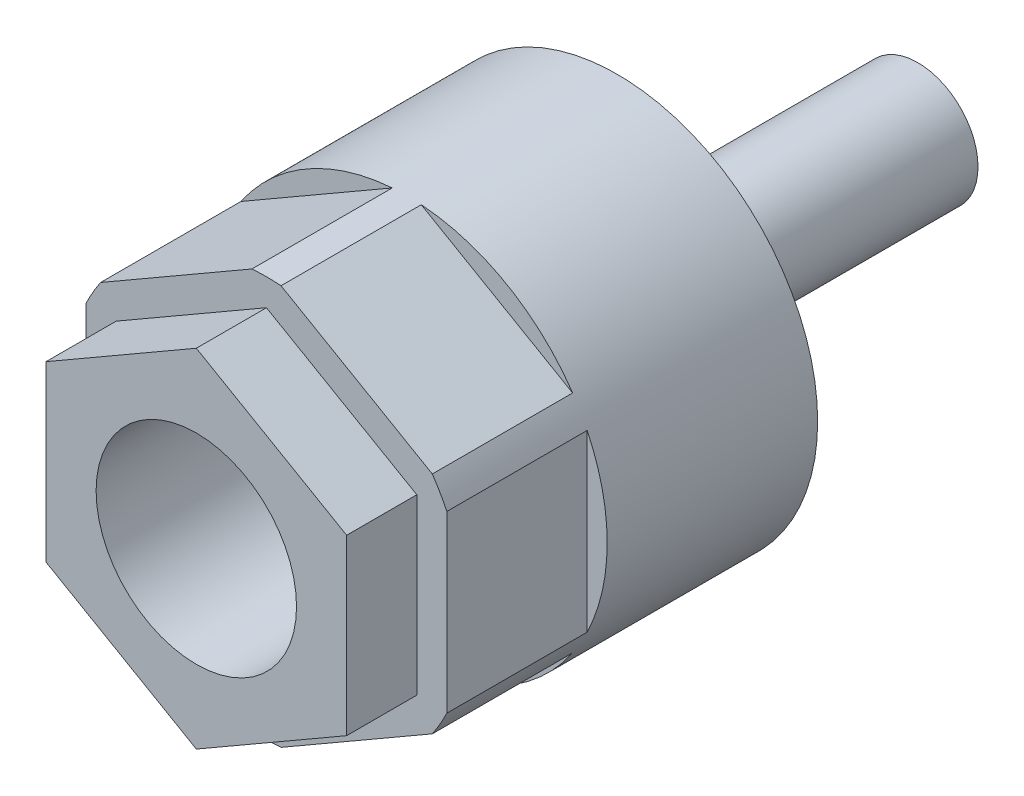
ISO-10303-21;
HEADER;
FILE_DESCRIPTION(('STEP AP214'),'2;1');
FILE_NAME('part.step','',(''),(''),'','','');
FILE_SCHEMA(('AUTOMOTIVE_DESIGN { 1 0 10303 214 1 1 1 1 }'));
ENDSEC;
DATA;
#1=APPLICATION_CONTEXT('core data for automotive mechanical design processes');
#2=APPLICATION_PROTOCOL_DEFINITION('international standard','automotive_design',2000,#1);
#3=PRODUCT_CONTEXT('',#1,'mechanical');
#4=PRODUCT('Part','Part','',(#3));
#5=PRODUCT_RELATED_PRODUCT_CATEGORY('part','',(#4));
#6=PRODUCT_DEFINITION_FORMATION('','',#4);
#7=PRODUCT_DEFINITION_CONTEXT('part definition',#1,'design');
#8=PRODUCT_DEFINITION('design','',#6,#7);
#9=PRODUCT_DEFINITION_SHAPE('','',#8);
#10=(LENGTH_UNIT() NAMED_UNIT(*) SI_UNIT(.MILLI.,.METRE.));
#11=(NAMED_UNIT(*) PLANE_ANGLE_UNIT() SI_UNIT($,.RADIAN.));
#12=(NAMED_UNIT(*) SI_UNIT($,.STERADIAN.) SOLID_ANGLE_UNIT());
#13=UNCERTAINTY_MEASURE_WITH_UNIT(LENGTH_MEASURE(1.E-05),#10,'distance_accuracy_value','');
#14=(GEOMETRIC_REPRESENTATION_CONTEXT(3) GLOBAL_UNCERTAINTY_ASSIGNED_CONTEXT((#13)) GLOBAL_UNIT_ASSIGNED_CONTEXT((#10,
#11,#12)) REPRESENTATION_CONTEXT('',''));
#15=CARTESIAN_POINT('',(0.,0.,0.));
#16=DIRECTION('',(0.,0.,1.));
#17=DIRECTION('',(1.,0.,0.));
#18=AXIS2_PLACEMENT_3D('',#15,#16,#17);
#19=CARTESIAN_POINT('',(0.,0.,80.));
#20=DIRECTION('',(0.,0.,1.));
#21=DIRECTION('',(1.,0.,0.));
#22=AXIS2_PLACEMENT_3D('',#19,#20,#21);
#23=CYLINDRICAL_SURFACE('',#22,20.);
#24=CARTESIAN_POINT('',(0.,0.,0.));
#25=DIRECTION('',(0.,0.,1.));
#26=DIRECTION('',(1.,0.,0.));
#27=AXIS2_PLACEMENT_3D('',#24,#25,#26);
#28=CIRCLE('',#27,20.);
#29=CARTESIAN_POINT('',(20.,0.,0.));
#30=VERTEX_POINT('',#29);
#31=EDGE_CURVE('E241',#30,#30,#28,.T.);
#32=ORIENTED_EDGE('',*,*,#31,.T.);
#33=EDGE_LOOP('',(#32));
#34=FACE_BOUND('',#33,.T.);
#35=DIRECTION('',(0.,0.,1.));
#36=VECTOR('',#35,1.);
#37=CARTESIAN_POINT('',(18.,-8.71779788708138,80.));
#38=LINE('',#37,#36);
#39=CARTESIAN_POINT('',(18.,-8.71779788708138,21.));
#40=VERTEX_POINT('',#39);
#41=CARTESIAN_POINT('',(18.,-8.71779788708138,35.));
#42=VERTEX_POINT('',#41);
#43=EDGE_CURVE('E271',#40,#42,#38,.T.);
#44=ORIENTED_EDGE('',*,*,#43,.T.);
#45=CARTESIAN_POINT('',(0.,0.,35.));
#46=DIRECTION('',(0.,0.,1.));
#47=DIRECTION('',(1.,0.,0.));
#48=AXIS2_PLACEMENT_3D('',#45,#46,#47);
#49=CIRCLE('',#48,20.);
#50=CARTESIAN_POINT('',(16.5498344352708,-11.2295583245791,35.));
#51=VERTEX_POINT('',#50);
#52=EDGE_CURVE('E205',#42,#51,#49,.F.);
#53=ORIENTED_EDGE('',*,*,#52,.T.);
#54=DIRECTION('',(0.,0.,1.));
#55=VECTOR('',#54,1.);
#56=CARTESIAN_POINT('',(16.5498344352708,-11.2295583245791,80.));
#57=LINE('',#56,#55);
#58=CARTESIAN_POINT('',(16.5498344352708,-11.2295583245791,21.));
#59=VERTEX_POINT('',#58);
#60=EDGE_CURVE('E265',#59,#51,#57,.T.);
#61=ORIENTED_EDGE('',*,*,#60,.F.);
#62=CARTESIAN_POINT('',(0.,0.,21.));
#63=DIRECTION('',(0.,0.,1.));
#64=DIRECTION('',(1.,0.,0.));
#65=AXIS2_PLACEMENT_3D('',#62,#63,#64);
#66=CIRCLE('',#65,20.);
#67=CARTESIAN_POINT('',(1.45016556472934,-19.9473562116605,21.));
#68=VERTEX_POINT('',#67);
#69=EDGE_CURVE('E268',#59,#68,#66,.F.);
#70=ORIENTED_EDGE('',*,*,#69,.T.);
#71=DIRECTION('',(0.,0.,1.));
#72=VECTOR('',#71,1.);
#73=CARTESIAN_POINT('',(1.45016556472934,-19.9473562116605,80.));
#74=LINE('',#73,#72);
#75=CARTESIAN_POINT('',(1.45016556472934,-19.9473562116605,35.));
#76=VERTEX_POINT('',#75);
#77=EDGE_CURVE('E269',#76,#68,#74,.F.);
#78=ORIENTED_EDGE('',*,*,#77,.F.);
#79=CARTESIAN_POINT('',(-1.45016556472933,-19.9473562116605,35.));
#80=VERTEX_POINT('',#79);
#81=EDGE_CURVE('E195',#76,#80,#49,.F.);
#82=ORIENTED_EDGE('',*,*,#81,.T.);
#83=DIRECTION('',(0.,0.,1.));
#84=VECTOR('',#83,1.);
#85=CARTESIAN_POINT('',(-1.45016556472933,-19.9473562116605,80.));
#86=LINE('',#85,#84);
#87=CARTESIAN_POINT('',(-1.45016556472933,-19.9473562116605,21.));
#88=VERTEX_POINT('',#87);
#89=EDGE_CURVE('E263',#80,#88,#86,.F.);
#90=ORIENTED_EDGE('',*,*,#89,.T.);
#91=CARTESIAN_POINT('',(-16.5498344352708,-11.2295583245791,21.));
#92=VERTEX_POINT('',#91);
#93=EDGE_CURVE('E262',#88,#92,#66,.F.);
#94=ORIENTED_EDGE('',*,*,#93,.T.);
#95=DIRECTION('',(0.,0.,1.));
#96=VECTOR('',#95,1.);
#97=CARTESIAN_POINT('',(-16.5498344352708,-11.2295583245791,80.));
#98=LINE('',#97,#96);
#99=CARTESIAN_POINT('',(-16.5498344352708,-11.2295583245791,35.));
#100=VERTEX_POINT('',#99);
#101=EDGE_CURVE('E259',#92,#100,#98,.T.);
#102=ORIENTED_EDGE('',*,*,#101,.T.);
#103=CARTESIAN_POINT('',(-18.,-8.71779788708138,35.));
#104=VERTEX_POINT('',#103);
#105=EDGE_CURVE('E207',#100,#104,#49,.F.);
#106=ORIENTED_EDGE('',*,*,#105,.T.);
#107=DIRECTION('',(0.,0.,1.));
#108=VECTOR('',#107,1.);
#109=CARTESIAN_POINT('',(-18.,-8.71779788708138,80.));
#110=LINE('',#109,#108);
#111=CARTESIAN_POINT('',(-18.,-8.71779788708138,21.));
#112=VERTEX_POINT('',#111);
#113=EDGE_CURVE('E254',#112,#104,#110,.T.);
#114=ORIENTED_EDGE('',*,*,#113,.F.);
#115=CARTESIAN_POINT('',(-18.,8.71779788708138,21.));
#116=VERTEX_POINT('',#115);
#117=EDGE_CURVE('E252',#112,#116,#66,.F.);
#118=ORIENTED_EDGE('',*,*,#117,.T.);
#119=DIRECTION('',(0.,0.,1.));
#120=VECTOR('',#119,1.);
#121=CARTESIAN_POINT('',(-18.,8.71779788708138,80.));
#122=LINE('',#121,#120);
#123=CARTESIAN_POINT('',(-18.,8.71779788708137,35.));
#124=VERTEX_POINT('',#123);
#125=EDGE_CURVE('E257',#124,#116,#122,.F.);
#126=ORIENTED_EDGE('',*,*,#125,.F.);
#127=CARTESIAN_POINT('',(-16.5498344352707,11.2295583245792,35.));
#128=VERTEX_POINT('',#127);
#129=EDGE_CURVE('E201',#124,#128,#49,.F.);
#130=ORIENTED_EDGE('',*,*,#129,.T.);
#131=DIRECTION('',(0.,0.,1.));
#132=VECTOR('',#131,1.);
#133=CARTESIAN_POINT('',(-16.5498344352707,11.2295583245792,80.));
#134=LINE('',#133,#132);
#135=CARTESIAN_POINT('',(-16.5498344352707,11.2295583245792,21.));
#136=VERTEX_POINT('',#135);
#137=EDGE_CURVE('E244',#136,#128,#134,.T.);
#138=ORIENTED_EDGE('',*,*,#137,.F.);
#139=CARTESIAN_POINT('',(-1.45016556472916,19.9473562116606,21.));
#140=VERTEX_POINT('',#139);
#141=EDGE_CURVE('E247',#136,#140,#66,.F.);
#142=ORIENTED_EDGE('',*,*,#141,.T.);
#143=DIRECTION('',(0.,0.,1.));
#144=VECTOR('',#143,1.);
#145=CARTESIAN_POINT('',(-1.45016556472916,19.9473562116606,80.));
#146=LINE('',#145,#144);
#147=CARTESIAN_POINT('',(-1.45016556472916,19.9473562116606,35.));
#148=VERTEX_POINT('',#147);
#149=EDGE_CURVE('E250',#148,#140,#146,.F.);
#150=ORIENTED_EDGE('',*,*,#149,.F.);
#151=CARTESIAN_POINT('',(1.45016556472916,19.9473562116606,35.));
#152=VERTEX_POINT('',#151);
#153=EDGE_CURVE('E194',#148,#152,#49,.F.);
#154=ORIENTED_EDGE('',*,*,#153,.T.);
#155=DIRECTION('',(0.,0.,1.));
#156=VECTOR('',#155,1.);
#157=CARTESIAN_POINT('',(1.45016556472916,19.9473562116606,80.));
#158=LINE('',#157,#156);
#159=CARTESIAN_POINT('',(1.45016556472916,19.9473562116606,21.));
#160=VERTEX_POINT('',#159);
#161=EDGE_CURVE('E22',#152,#160,#158,.F.);
#162=ORIENTED_EDGE('',*,*,#161,.T.);
#163=CARTESIAN_POINT('',(16.5498344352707,11.2295583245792,21.));
#164=VERTEX_POINT('',#163);
#165=EDGE_CURVE('E251',#160,#164,#66,.F.);
#166=ORIENTED_EDGE('',*,*,#165,.T.);
#167=DIRECTION('',(0.,0.,1.));
#168=VECTOR('',#167,1.);
#169=CARTESIAN_POINT('',(16.5498344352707,11.2295583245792,80.));
#170=LINE('',#169,#168);
#171=CARTESIAN_POINT('',(16.5498344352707,11.2295583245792,35.));
#172=VERTEX_POINT('',#171);
#173=EDGE_CURVE('E277',#164,#172,#170,.T.);
#174=ORIENTED_EDGE('',*,*,#173,.T.);
#175=CARTESIAN_POINT('',(18.,8.71779788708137,35.));
#176=VERTEX_POINT('',#175);
#177=EDGE_CURVE('E37',#172,#176,#49,.F.);
#178=ORIENTED_EDGE('',*,*,#177,.T.);
#179=DIRECTION('',(0.,0.,1.));
#180=VECTOR('',#179,1.);
#181=CARTESIAN_POINT('',(18.,8.71779788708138,80.));
#182=LINE('',#181,#180);
#183=CARTESIAN_POINT('',(18.,8.71779788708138,21.));
#184=VERTEX_POINT('',#183);
#185=EDGE_CURVE('E275',#176,#184,#182,.F.);
#186=ORIENTED_EDGE('',*,*,#185,.T.);
#187=EDGE_CURVE('E274',#184,#40,#66,.F.);
#188=ORIENTED_EDGE('',*,*,#187,.T.);
#189=EDGE_LOOP('',(#44,#53,#61,#70,#78,#82,#90,#94,#102,#106,#114,#118,#126,#130,#138,#142,#150,
#154,#162,#166,#174,#178,#186,#188));
#190=FACE_BOUND('',#189,.T.);
#191=ADVANCED_FACE('F14',(#34,#190),#23,.T.);
#192=CARTESIAN_POINT('',(-18.,10.3923048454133,21.));
#193=DIRECTION('',(0.5,-0.86602540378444,0.));
#194=DIRECTION('',(0.86602540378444,0.5,0.));
#195=AXIS2_PLACEMENT_3D('',#192,#193,#194);
#196=PLANE('',#195);
#197=DIRECTION('',(-0.86602540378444,-0.5,0.));
#198=VECTOR('',#197,1.);
#199=CARTESIAN_POINT('',(-18.,10.3923048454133,35.));
#200=LINE('',#199,#198);
#201=EDGE_CURVE('E199',#148,#128,#200,.T.);
#202=ORIENTED_EDGE('',*,*,#201,.F.);
#203=ORIENTED_EDGE('',*,*,#149,.T.);
#204=DIRECTION('',(0.86602540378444,0.5,0.));
#205=VECTOR('',#204,1.);
#206=CARTESIAN_POINT('',(-18.,10.3923048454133,21.));
#207=LINE('',#206,#205);
#208=EDGE_CURVE('E225',#136,#140,#207,.T.);
#209=ORIENTED_EDGE('',*,*,#208,.F.);
#210=ORIENTED_EDGE('',*,*,#137,.T.);
#211=EDGE_LOOP('',(#202,#203,#209,#210));
#212=FACE_BOUND('',#211,.T.);
#213=ADVANCED_FACE('F334',(#212),#196,.F.);
#214=CARTESIAN_POINT('',(-18.,-10.3923048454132,21.));
#215=DIRECTION('',(1.,0.,0.));
#216=DIRECTION('',(0.,0.,-1.));
#217=AXIS2_PLACEMENT_3D('',#214,#215,#216);
#218=PLANE('',#217);
#219=DIRECTION('',(0.,-1.,0.));
#220=VECTOR('',#219,1.);
#221=CARTESIAN_POINT('',(-18.,-10.3923048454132,35.));
#222=LINE('',#221,#220);
#223=EDGE_CURVE('E204',#124,#104,#222,.T.);
#224=ORIENTED_EDGE('',*,*,#223,.F.);
#225=ORIENTED_EDGE('',*,*,#125,.T.);
#226=DIRECTION('',(0.,1.,0.));
#227=VECTOR('',#226,1.);
#228=CARTESIAN_POINT('',(-18.,-10.3923048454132,21.));
#229=LINE('',#228,#227);
#230=EDGE_CURVE('E222',#112,#116,#229,.T.);
#231=ORIENTED_EDGE('',*,*,#230,.F.);
#232=ORIENTED_EDGE('',*,*,#113,.T.);
#233=EDGE_LOOP('',(#224,#225,#231,#232));
#234=FACE_BOUND('',#233,.T.);
#235=ADVANCED_FACE('F302',(#234),#218,.F.);
#236=CARTESIAN_POINT('',(-18.,-10.3923048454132,21.));
#237=DIRECTION('',(-0.5,-0.866025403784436,0.));
#238=DIRECTION('',(0.866025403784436,-0.5,0.));
#239=AXIS2_PLACEMENT_3D('',#236,#237,#238);
#240=PLANE('',#239);
#241=ORIENTED_EDGE('',*,*,#89,.F.);
#242=DIRECTION('',(-0.866025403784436,0.5,0.));
#243=VECTOR('',#242,1.);
#244=CARTESIAN_POINT('',(-18.,-10.3923048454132,35.));
#245=LINE('',#244,#243);
#246=EDGE_CURVE('E208',#80,#100,#245,.T.);
#247=ORIENTED_EDGE('',*,*,#246,.T.);
#248=ORIENTED_EDGE('',*,*,#101,.F.);
#249=DIRECTION('',(0.866025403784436,-0.5,0.));
#250=VECTOR('',#249,1.);
#251=CARTESIAN_POINT('',(-18.,-10.3923048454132,21.));
#252=LINE('',#251,#250);
#253=EDGE_CURVE('E219',#92,#88,#252,.T.);
#254=ORIENTED_EDGE('',*,*,#253,.T.);
#255=EDGE_LOOP('',(#241,#247,#248,#254));
#256=FACE_BOUND('',#255,.T.);
#257=ADVANCED_FACE('F489',(#256),#240,.T.);
#258=CARTESIAN_POINT('',(18.,-10.3923048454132,21.));
#259=DIRECTION('',(-0.5,0.866025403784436,0.));
#260=DIRECTION('',(-0.866025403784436,-0.5,0.));
#261=AXIS2_PLACEMENT_3D('',#258,#259,#260);
#262=PLANE('',#261);
#263=DIRECTION('',(0.866025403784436,0.5,0.));
#264=VECTOR('',#263,1.);
#265=CARTESIAN_POINT('',(18.,-10.3923048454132,35.));
#266=LINE('',#265,#264);
#267=EDGE_CURVE('E202',#76,#51,#266,.T.);
#268=ORIENTED_EDGE('',*,*,#267,.F.);
#269=ORIENTED_EDGE('',*,*,#77,.T.);
#270=DIRECTION('',(-0.866025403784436,-0.5,0.));
#271=VECTOR('',#270,1.);
#272=CARTESIAN_POINT('',(18.,-10.3923048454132,21.));
#273=LINE('',#272,#271);
#274=EDGE_CURVE('E216',#59,#68,#273,.T.);
#275=ORIENTED_EDGE('',*,*,#274,.F.);
#276=ORIENTED_EDGE('',*,*,#60,.T.);
#277=EDGE_LOOP('',(#268,#269,#275,#276));
#278=FACE_BOUND('',#277,.T.);
#279=ADVANCED_FACE('F480',(#278),#262,.F.);
#280=CARTESIAN_POINT('',(18.,-10.3923048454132,21.));
#281=DIRECTION('',(1.,0.,0.));
#282=DIRECTION('',(0.,0.,-1.));
#283=AXIS2_PLACEMENT_3D('',#280,#281,#282);
#284=PLANE('',#283);
#285=ORIENTED_EDGE('',*,*,#185,.F.);
#286=DIRECTION('',(0.,-1.,0.));
#287=VECTOR('',#286,1.);
#288=CARTESIAN_POINT('',(18.,-10.3923048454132,35.));
#289=LINE('',#288,#287);
#290=EDGE_CURVE('E196',#176,#42,#289,.T.);
#291=ORIENTED_EDGE('',*,*,#290,.T.);
#292=ORIENTED_EDGE('',*,*,#43,.F.);
#293=DIRECTION('',(0.,1.,0.));
#294=VECTOR('',#293,1.);
#295=CARTESIAN_POINT('',(18.,-10.3923048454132,21.));
#296=LINE('',#295,#294);
#297=EDGE_CURVE('E212',#40,#184,#296,.T.);
#298=ORIENTED_EDGE('',*,*,#297,.T.);
#299=EDGE_LOOP('',(#285,#291,#292,#298));
#300=FACE_BOUND('',#299,.T.);
#301=ADVANCED_FACE('F470',(#300),#284,.T.);
#302=CARTESIAN_POINT('',(18.,10.3923048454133,21.));
#303=DIRECTION('',(0.5,0.86602540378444,0.));
#304=DIRECTION('',(-0.86602540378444,0.5,0.));
#305=AXIS2_PLACEMENT_3D('',#302,#303,#304);
#306=PLANE('',#305);
#307=ORIENTED_EDGE('',*,*,#161,.F.);
#308=DIRECTION('',(0.86602540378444,-0.5,0.));
#309=VECTOR('',#308,1.);
#310=CARTESIAN_POINT('',(18.,10.3923048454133,35.));
#311=LINE('',#310,#309);
#312=EDGE_CURVE('E9',#152,#172,#311,.T.);
#313=ORIENTED_EDGE('',*,*,#312,.T.);
#314=ORIENTED_EDGE('',*,*,#173,.F.);
#315=DIRECTION('',(-0.86602540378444,0.5,0.));
#316=VECTOR('',#315,1.);
#317=CARTESIAN_POINT('',(18.,10.3923048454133,21.));
#318=LINE('',#317,#316);
#319=EDGE_CURVE('E211',#164,#160,#318,.T.);
#320=ORIENTED_EDGE('',*,*,#319,.T.);
#321=EDGE_LOOP('',(#307,#313,#314,#320));
#322=FACE_BOUND('',#321,.T.);
#323=ADVANCED_FACE('F311',(#322),#306,.T.);
#324=CARTESIAN_POINT('',(20.,0.,0.));
#325=DIRECTION('',(0.,0.,-1.));
#326=DIRECTION('',(-1.,0.,0.));
#327=AXIS2_PLACEMENT_3D('',#324,#325,#326);
#328=PLANE('',#327);
#329=CARTESIAN_POINT('',(0.,0.,0.));
#330=DIRECTION('',(0.,0.,1.));
#331=DIRECTION('',(1.,0.,0.));
#332=AXIS2_PLACEMENT_3D('',#329,#330,#331);
#333=CIRCLE('',#332,6.);
#334=CARTESIAN_POINT('',(6.,0.,0.));
#335=VERTEX_POINT('',#334);
#336=EDGE_CURVE('E238',#335,#335,#333,.T.);
#337=ORIENTED_EDGE('',*,*,#336,.T.);
#338=EDGE_LOOP('',(#337));
#339=FACE_BOUND('',#338,.T.);
#340=ORIENTED_EDGE('',*,*,#31,.F.);
#341=EDGE_LOOP('',(#340));
#342=FACE_BOUND('',#341,.T.);
#343=ADVANCED_FACE('F343',(#339,#342),#328,.T.);
#344=CARTESIAN_POINT('',(0.,0.,80.));
#345=DIRECTION('',(0.,0.,1.));
#346=DIRECTION('',(1.,0.,0.));
#347=AXIS2_PLACEMENT_3D('',#344,#345,#346);
#348=CYLINDRICAL_SURFACE('',#347,6.);
#349=CARTESIAN_POINT('',(0.,0.,-30.));
#350=DIRECTION('',(0.,0.,1.));
#351=DIRECTION('',(1.,0.,0.));
#352=AXIS2_PLACEMENT_3D('',#349,#350,#351);
#353=CIRCLE('',#352,6.);
#354=CARTESIAN_POINT('',(6.,0.,-30.));
#355=VERTEX_POINT('',#354);
#356=EDGE_CURVE('E235',#355,#355,#353,.T.);
#357=ORIENTED_EDGE('',*,*,#356,.T.);
#358=EDGE_LOOP('',(#357));
#359=FACE_BOUND('',#358,.T.);
#360=ORIENTED_EDGE('',*,*,#336,.F.);
#361=EDGE_LOOP('',(#360));
#362=FACE_BOUND('',#361,.T.);
#363=ADVANCED_FACE('F346',(#359,#362),#348,.T.);
#364=CARTESIAN_POINT('',(6.,0.,-30.));
#365=DIRECTION('',(0.,0.,-1.));
#366=DIRECTION('',(-1.,0.,0.));
#367=AXIS2_PLACEMENT_3D('',#364,#365,#366);
#368=PLANE('',#367);
#369=ORIENTED_EDGE('',*,*,#356,.F.);
#370=EDGE_LOOP('',(#369));
#371=FACE_BOUND('',#370,.T.);
#372=ADVANCED_FACE('F331',(#371),#368,.T.);
#373=CARTESIAN_POINT('',(0.,0.,21.));
#374=DIRECTION('',(0.,0.,1.));
#375=DIRECTION('',(1.,0.,0.));
#376=AXIS2_PLACEMENT_3D('',#373,#374,#375);
#377=PLANE('',#376);
#378=ORIENTED_EDGE('',*,*,#208,.T.);
#379=ORIENTED_EDGE('',*,*,#141,.F.);
#380=EDGE_LOOP('',(#378,#379));
#381=FACE_BOUND('',#380,.T.);
#382=ADVANCED_FACE('F318',(#381),#377,.T.);
#383=ORIENTED_EDGE('',*,*,#230,.T.);
#384=ORIENTED_EDGE('',*,*,#117,.F.);
#385=EDGE_LOOP('',(#383,#384));
#386=FACE_BOUND('',#385,.T.);
#387=ADVANCED_FACE('F299',(#386),#377,.T.);
#388=ORIENTED_EDGE('',*,*,#253,.F.);
#389=ORIENTED_EDGE('',*,*,#93,.F.);
#390=EDGE_LOOP('',(#388,#389));
#391=FACE_BOUND('',#390,.T.);
#392=ADVANCED_FACE('F444',(#391),#377,.T.);
#393=ORIENTED_EDGE('',*,*,#274,.T.);
#394=ORIENTED_EDGE('',*,*,#69,.F.);
#395=EDGE_LOOP('',(#393,#394));
#396=FACE_BOUND('',#395,.T.);
#397=ADVANCED_FACE('F326',(#396),#377,.T.);
#398=ORIENTED_EDGE('',*,*,#297,.F.);
#399=ORIENTED_EDGE('',*,*,#187,.F.);
#400=EDGE_LOOP('',(#398,#399));
#401=FACE_BOUND('',#400,.T.);
#402=ADVANCED_FACE('F316',(#401),#377,.T.);
#403=ORIENTED_EDGE('',*,*,#319,.F.);
#404=ORIENTED_EDGE('',*,*,#165,.F.);
#405=EDGE_LOOP('',(#403,#404));
#406=FACE_BOUND('',#405,.T.);
#407=ADVANCED_FACE('F314',(#406),#377,.T.);
#408=CARTESIAN_POINT('',(0.,0.,35.));
#409=DIRECTION('',(0.,0.,1.));
#410=DIRECTION('',(1.,0.,0.));
#411=AXIS2_PLACEMENT_3D('',#408,#409,#410);
#412=PLANE('',#411);
#413=ORIENTED_EDGE('',*,*,#81,.F.);
#414=ORIENTED_EDGE('',*,*,#267,.T.);
#415=ORIENTED_EDGE('',*,*,#52,.F.);
#416=ORIENTED_EDGE('',*,*,#290,.F.);
#417=ORIENTED_EDGE('',*,*,#177,.F.);
#418=ORIENTED_EDGE('',*,*,#312,.F.);
#419=ORIENTED_EDGE('',*,*,#153,.F.);
#420=ORIENTED_EDGE('',*,*,#201,.T.);
#421=ORIENTED_EDGE('',*,*,#129,.F.);
#422=ORIENTED_EDGE('',*,*,#223,.T.);
#423=ORIENTED_EDGE('',*,*,#105,.F.);
#424=ORIENTED_EDGE('',*,*,#246,.F.);
#425=EDGE_LOOP('',(#413,#414,#415,#416,#417,#418,#419,#420,#421,#422,#423,#424));
#426=FACE_BOUND('',#425,.T.);
#427=DIRECTION('',(-0.866025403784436,-0.5,0.));
#428=VECTOR('',#427,1.);
#429=CARTESIAN_POINT('',(15.,-8.66025403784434,35.));
#430=LINE('',#429,#428);
#431=CARTESIAN_POINT('',(15.,-8.66025403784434,35.));
#432=VERTEX_POINT('',#431);
#433=CARTESIAN_POINT('',(0.,-17.3205080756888,35.));
#434=VERTEX_POINT('',#433);
#435=EDGE_CURVE('E182',#432,#434,#430,.T.);
#436=ORIENTED_EDGE('',*,*,#435,.T.);
#437=DIRECTION('',(0.866025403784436,-0.5,0.));
#438=VECTOR('',#437,1.);
#439=CARTESIAN_POINT('',(-15.,-8.66025403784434,35.));
#440=LINE('',#439,#438);
#441=CARTESIAN_POINT('',(-15.,-8.66025403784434,35.));
#442=VERTEX_POINT('',#441);
#443=EDGE_CURVE('E146',#442,#434,#440,.T.);
#444=ORIENTED_EDGE('',*,*,#443,.F.);
#445=DIRECTION('',(0.,1.,0.));
#446=VECTOR('',#445,1.);
#447=CARTESIAN_POINT('',(-15.,-8.66025403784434,35.));
#448=LINE('',#447,#446);
#449=CARTESIAN_POINT('',(-15.,8.66025403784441,35.));
#450=VERTEX_POINT('',#449);
#451=EDGE_CURVE('E178',#442,#450,#448,.T.);
#452=ORIENTED_EDGE('',*,*,#451,.T.);
#453=DIRECTION('',(0.866025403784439,0.5,0.));
#454=VECTOR('',#453,1.);
#455=CARTESIAN_POINT('',(-15.,8.66025403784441,35.));
#456=LINE('',#455,#454);
#457=CARTESIAN_POINT('',(0.,17.3205080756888,35.));
#458=VERTEX_POINT('',#457);
#459=EDGE_CURVE('E175',#450,#458,#456,.T.);
#460=ORIENTED_EDGE('',*,*,#459,.T.);
#461=DIRECTION('',(-0.866025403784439,0.5,0.));
#462=VECTOR('',#461,1.);
#463=CARTESIAN_POINT('',(15.,8.66025403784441,35.));
#464=LINE('',#463,#462);
#465=CARTESIAN_POINT('',(15.,8.66025403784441,35.));
#466=VERTEX_POINT('',#465);
#467=EDGE_CURVE('E172',#466,#458,#464,.T.);
#468=ORIENTED_EDGE('',*,*,#467,.F.);
#469=DIRECTION('',(0.,1.,0.));
#470=VECTOR('',#469,1.);
#471=CARTESIAN_POINT('',(15.,-8.66025403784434,35.));
#472=LINE('',#471,#470);
#473=EDGE_CURVE('E169',#432,#466,#472,.T.);
#474=ORIENTED_EDGE('',*,*,#473,.F.);
#475=EDGE_LOOP('',(#436,#444,#452,#460,#468,#474));
#476=FACE_BOUND('',#475,.T.);
#477=ADVANCED_FACE('F303',(#426,#476),#412,.T.);
#478=CARTESIAN_POINT('',(15.,-8.66025403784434,35.));
#479=DIRECTION('',(-0.5,0.866025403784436,0.));
#480=DIRECTION('',(-0.866025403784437,-0.5,0.));
#481=AXIS2_PLACEMENT_3D('',#478,#479,#480);
#482=PLANE('',#481);
#483=DIRECTION('',(0.,0.,1.));
#484=VECTOR('',#483,1.);
#485=CARTESIAN_POINT('',(0.,-17.3205080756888,35.));
#486=LINE('',#485,#484);
#487=CARTESIAN_POINT('',(0.,-17.3205080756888,42.));
#488=VERTEX_POINT('',#487);
#489=EDGE_CURVE('E139',#434,#488,#486,.T.);
#490=ORIENTED_EDGE('',*,*,#489,.F.);
#491=ORIENTED_EDGE('',*,*,#435,.F.);
#492=DIRECTION('',(0.,0.,1.));
#493=VECTOR('',#492,1.);
#494=CARTESIAN_POINT('',(15.,-8.66025403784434,35.));
#495=LINE('',#494,#493);
#496=CARTESIAN_POINT('',(15.,-8.66025403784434,42.));
#497=VERTEX_POINT('',#496);
#498=EDGE_CURVE('E155',#432,#497,#495,.T.);
#499=ORIENTED_EDGE('',*,*,#498,.T.);
#500=DIRECTION('',(-0.866025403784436,-0.5,0.));
#501=VECTOR('',#500,1.);
#502=CARTESIAN_POINT('',(15.,-8.66025403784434,42.));
#503=LINE('',#502,#501);
#504=EDGE_CURVE('E153',#497,#488,#503,.T.);
#505=ORIENTED_EDGE('',*,*,#504,.T.);
#506=EDGE_LOOP('',(#490,#491,#499,#505));
#507=FACE_BOUND('',#506,.T.);
#508=ADVANCED_FACE('F154',(#507),#482,.F.);
#509=CARTESIAN_POINT('',(-15.,-8.66025403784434,35.));
#510=DIRECTION('',(-0.5,-0.866025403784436,0.));
#511=DIRECTION('',(0.866025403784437,-0.5,0.));
#512=AXIS2_PLACEMENT_3D('',#509,#510,#511);
#513=PLANE('',#512);
#514=DIRECTION('',(0.,0.,1.));
#515=VECTOR('',#514,1.);
#516=CARTESIAN_POINT('',(-15.,-8.66025403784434,35.));
#517=LINE('',#516,#515);
#518=CARTESIAN_POINT('',(-15.,-8.66025403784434,42.));
#519=VERTEX_POINT('',#518);
#520=EDGE_CURVE('E150',#442,#519,#517,.T.);
#521=ORIENTED_EDGE('',*,*,#520,.F.);
#522=ORIENTED_EDGE('',*,*,#443,.T.);
#523=ORIENTED_EDGE('',*,*,#489,.T.);
#524=DIRECTION('',(0.866025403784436,-0.5,0.));
#525=VECTOR('',#524,1.);
#526=CARTESIAN_POINT('',(-15.,-8.66025403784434,42.));
#527=LINE('',#526,#525);
#528=EDGE_CURVE('E143',#519,#488,#527,.T.);
#529=ORIENTED_EDGE('',*,*,#528,.F.);
#530=EDGE_LOOP('',(#521,#522,#523,#529));
#531=FACE_BOUND('',#530,.T.);
#532=ADVANCED_FACE('F141',(#531),#513,.T.);
#533=CARTESIAN_POINT('',(-15.,-8.66025403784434,35.));
#534=DIRECTION('',(1.,0.,0.));
#535=DIRECTION('',(0.,0.,-1.));
#536=AXIS2_PLACEMENT_3D('',#533,#534,#535);
#537=PLANE('',#536);
#538=DIRECTION('',(0.,0.,1.));
#539=VECTOR('',#538,1.);
#540=CARTESIAN_POINT('',(-15.,8.66025403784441,35.));
#541=LINE('',#540,#539);
#542=CARTESIAN_POINT('',(-15.,8.66025403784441,42.));
#543=VERTEX_POINT('',#542);
#544=EDGE_CURVE('E190',#450,#543,#541,.T.);
#545=ORIENTED_EDGE('',*,*,#544,.F.);
#546=ORIENTED_EDGE('',*,*,#451,.F.);
#547=ORIENTED_EDGE('',*,*,#520,.T.);
#548=DIRECTION('',(0.,1.,0.));
#549=VECTOR('',#548,1.);
#550=CARTESIAN_POINT('',(-15.,-8.66025403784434,42.));
#551=LINE('',#550,#549);
#552=EDGE_CURVE('E163',#519,#543,#551,.T.);
#553=ORIENTED_EDGE('',*,*,#552,.T.);
#554=EDGE_LOOP('',(#545,#546,#547,#553));
#555=FACE_BOUND('',#554,.T.);
#556=ADVANCED_FACE('F408',(#555),#537,.F.);
#557=CARTESIAN_POINT('',(-15.,8.66025403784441,35.));
#558=DIRECTION('',(0.5,-0.86602540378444,0.));
#559=DIRECTION('',(0.86602540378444,0.5,0.));
#560=AXIS2_PLACEMENT_3D('',#557,#558,#559);
#561=PLANE('',#560);
#562=DIRECTION('',(0.,0.,1.));
#563=VECTOR('',#562,1.);
#564=CARTESIAN_POINT('',(0.,17.3205080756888,35.));
#565=LINE('',#564,#563);
#566=CARTESIAN_POINT('',(0.,17.3205080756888,42.));
#567=VERTEX_POINT('',#566);
#568=EDGE_CURVE('E188',#458,#567,#565,.T.);
#569=ORIENTED_EDGE('',*,*,#568,.F.);
#570=ORIENTED_EDGE('',*,*,#459,.F.);
#571=ORIENTED_EDGE('',*,*,#544,.T.);
#572=DIRECTION('',(0.866025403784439,0.5,0.));
#573=VECTOR('',#572,1.);
#574=CARTESIAN_POINT('',(-15.,8.66025403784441,42.));
#575=LINE('',#574,#573);
#576=EDGE_CURVE('E165',#543,#567,#575,.T.);
#577=ORIENTED_EDGE('',*,*,#576,.T.);
#578=EDGE_LOOP('',(#569,#570,#571,#577));
#579=FACE_BOUND('',#578,.T.);
#580=ADVANCED_FACE('F399',(#579),#561,.F.);
#581=CARTESIAN_POINT('',(15.,8.66025403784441,35.));
#582=DIRECTION('',(0.5,0.866025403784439,0.));
#583=DIRECTION('',(-0.86602540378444,0.5,0.));
#584=AXIS2_PLACEMENT_3D('',#581,#582,#583);
#585=PLANE('',#584);
#586=DIRECTION('',(0.,0.,1.));
#587=VECTOR('',#586,1.);
#588=CARTESIAN_POINT('',(15.,8.66025403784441,35.));
#589=LINE('',#588,#587);
#590=CARTESIAN_POINT('',(15.,8.66025403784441,42.));
#591=VERTEX_POINT('',#590);
#592=EDGE_CURVE('E186',#466,#591,#589,.T.);
#593=ORIENTED_EDGE('',*,*,#592,.F.);
#594=ORIENTED_EDGE('',*,*,#467,.T.);
#595=ORIENTED_EDGE('',*,*,#568,.T.);
#596=DIRECTION('',(-0.866025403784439,0.5,0.));
#597=VECTOR('',#596,1.);
#598=CARTESIAN_POINT('',(15.,8.66025403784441,42.));
#599=LINE('',#598,#597);
#600=EDGE_CURVE('E29',#591,#567,#599,.T.);
#601=ORIENTED_EDGE('',*,*,#600,.F.);
#602=EDGE_LOOP('',(#593,#594,#595,#601));
#603=FACE_BOUND('',#602,.T.);
#604=ADVANCED_FACE('F388',(#603),#585,.T.);
#605=CARTESIAN_POINT('',(15.,-8.66025403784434,35.));
#606=DIRECTION('',(1.,0.,0.));
#607=DIRECTION('',(0.,0.,-1.));
#608=AXIS2_PLACEMENT_3D('',#605,#606,#607);
#609=PLANE('',#608);
#610=ORIENTED_EDGE('',*,*,#473,.T.);
#611=ORIENTED_EDGE('',*,*,#592,.T.);
#612=DIRECTION('',(0.,1.,0.));
#613=VECTOR('',#612,1.);
#614=CARTESIAN_POINT('',(15.,-8.66025403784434,42.));
#615=LINE('',#614,#613);
#616=EDGE_CURVE('E184',#497,#591,#615,.T.);
#617=ORIENTED_EDGE('',*,*,#616,.F.);
#618=ORIENTED_EDGE('',*,*,#498,.F.);
#619=EDGE_LOOP('',(#610,#611,#617,#618));
#620=FACE_BOUND('',#619,.T.);
#621=ADVANCED_FACE('F357',(#620),#609,.T.);
#622=CARTESIAN_POINT('',(10.,0.,6.));
#623=DIRECTION('',(0.,0.,-1.));
#624=DIRECTION('',(-1.,0.,0.));
#625=AXIS2_PLACEMENT_3D('',#622,#623,#624);
#626=PLANE('',#625);
#627=CARTESIAN_POINT('',(0.,0.,6.));
#628=DIRECTION('',(0.,0.,1.));
#629=DIRECTION('',(1.,0.,0.));
#630=AXIS2_PLACEMENT_3D('',#627,#628,#629);
#631=CIRCLE('',#630,10.);
#632=CARTESIAN_POINT('',(10.,0.,6.));
#633=VERTEX_POINT('',#632);
#634=EDGE_CURVE('E232',#633,#633,#631,.T.);
#635=ORIENTED_EDGE('',*,*,#634,.T.);
#636=EDGE_LOOP('',(#635));
#637=FACE_BOUND('',#636,.T.);
#638=ADVANCED_FACE('F354',(#637),#626,.F.);
#639=CARTESIAN_POINT('',(0.,0.,80.));
#640=DIRECTION('',(0.,0.,1.));
#641=DIRECTION('',(1.,0.,0.));
#642=AXIS2_PLACEMENT_3D('',#639,#640,#641);
#643=CYLINDRICAL_SURFACE('',#642,10.);
#644=ORIENTED_EDGE('',*,*,#634,.F.);
#645=EDGE_LOOP('',(#644));
#646=FACE_BOUND('',#645,.T.);
#647=CARTESIAN_POINT('',(0.,0.,42.));
#648=DIRECTION('',(0.,0.,1.));
#649=DIRECTION('',(1.,0.,0.));
#650=AXIS2_PLACEMENT_3D('',#647,#648,#649);
#651=CIRCLE('',#650,10.);
#652=CARTESIAN_POINT('',(10.,0.,42.));
#653=VERTEX_POINT('',#652);
#654=EDGE_CURVE('E215',#653,#653,#651,.T.);
#655=ORIENTED_EDGE('',*,*,#654,.T.);
#656=EDGE_LOOP('',(#655));
#657=FACE_BOUND('',#656,.T.);
#658=ADVANCED_FACE('F356',(#646,#657),#643,.F.);
#659=CARTESIAN_POINT('',(20.,0.,42.));
#660=DIRECTION('',(0.,0.,-1.));
#661=DIRECTION('',(-1.,0.,0.));
#662=AXIS2_PLACEMENT_3D('',#659,#660,#661);
#663=PLANE('',#662);
#664=ORIENTED_EDGE('',*,*,#528,.T.);
#665=ORIENTED_EDGE('',*,*,#504,.F.);
#666=ORIENTED_EDGE('',*,*,#616,.T.);
#667=ORIENTED_EDGE('',*,*,#600,.T.);
#668=ORIENTED_EDGE('',*,*,#576,.F.);
#669=ORIENTED_EDGE('',*,*,#552,.F.);
#670=EDGE_LOOP('',(#664,#665,#666,#667,#668,#669));
#671=FACE_BOUND('',#670,.T.);
#672=ORIENTED_EDGE('',*,*,#654,.F.);
#673=EDGE_LOOP('',(#672));
#674=FACE_BOUND('',#673,.T.);
#675=ADVANCED_FACE('F16',(#671,#674),#663,.F.);
#676=CLOSED_SHELL('',(#191,#213,#235,#257,#279,#301,#323,#343,#363,#372,#382,#387,#392,#397,
#402,#407,#477,#508,#532,#556,#580,#604,#621,#638,#658,#675));
#677=MANIFOLD_SOLID_BREP('B1',#676);
#678=ADVANCED_BREP_SHAPE_REPRESENTATION('',(#18,#677),#14);
#679=SHAPE_DEFINITION_REPRESENTATION(#9,#678);
ENDSEC;
END-ISO-10303-21;
